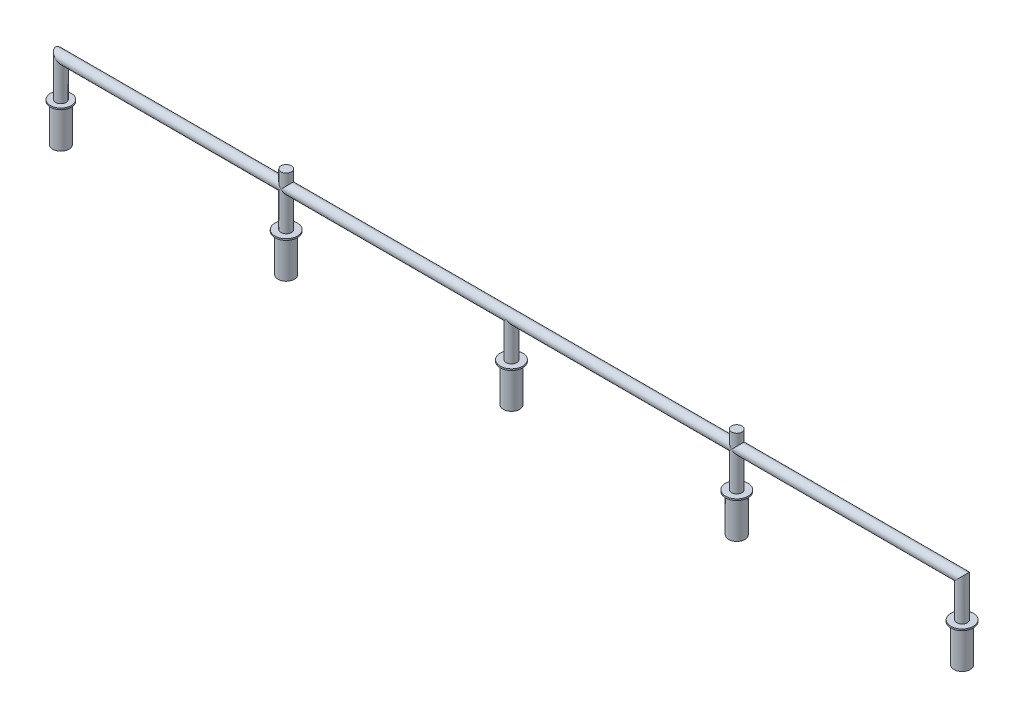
from build123d import *

# Parameters (mm, degrees)
BARRER1_PROFILE_R       = 7
BARRER2_PROFILE_R       = 7
BARRER3_PROFILE_R       = 7
BARRER4_PROFILE_R       = 7
BARRER5_PROFILE_R       = 7
BARRER6_PROFILE_R       = 7
CROQUIS128_R            = 14
CROQUIS128_R_2          = 15
SALIENTE_EXTRUIR1_DEPTH = 2
CROQUIS129_R            = 10.862522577
SALIENTE_EXTRUIR2_DEPTH = 50
MATRIZL1_COUNT          = 5
MATRIZL1_PITCH          = 300


with BuildPart() as part:
    # Barrer1: sweep along a path in Croquis1
    with BuildLine(Plane.XY) as barrer1_path:
        Line((-600, -50), (-600, 0))
        Line((-600, 0), (600, 0))
        Line((600, 0), (600, -100))
    # Barrer1 profile (on start of the path) → Barrer1 (sweep)
    with BuildSketch(Plane(origin=(-600, -50, 0), x_dir=(0, 0, 1), z_dir=(0, 1, 0))):
        Circle(BARRER1_PROFILE_R)
    sweep(path=barrer1_path.line, transition=Transition.RIGHT)

    # Barrer2: sweep along a path in Croquis12
    with BuildLine(Plane.XY) as barrer2_path:
        Line((-300, 0), (-300, -100))
    # Barrer2 profile (on start of the path) → Barrer2 (sweep)
    with BuildSketch(Plane(origin=(-300, 0, 0), x_dir=(0, 0, -1), z_dir=(0, -1, 0))):
        Circle(BARRER2_PROFILE_R)
    sweep(path=barrer2_path.line)

    # Barrer3: sweep along a path in Croquis94
    with BuildLine(Plane.XY) as barrer3_path:
        Line((0, -100), (0, 0))
    # Barrer3 profile (on start of the path) → Barrer3 (sweep)
    with BuildSketch(Plane.ZX.offset(-100)):
        Circle(BARRER3_PROFILE_R)
    sweep(path=barrer3_path.line)

    # Barrer4: sweep along a path in Croquis107
    with BuildLine(Plane.XY) as barrer4_path:
        Line((300, 0), (300, -100))
    # Barrer4 profile (on start of the path) → Barrer4 (sweep)
    with BuildSketch(Plane(origin=(300, 0, 0), x_dir=(0, 0, -1), z_dir=(0, -1, 0))):
        Circle(BARRER4_PROFILE_R)
    sweep(path=barrer4_path.line)

    # Barrer5: sweep along a path in Croquis108
    with BuildLine(Plane.XY) as barrer5_path:
        Line((-300, 0), (-300, 20))
    # Barrer5 profile (on start of the path) → Barrer5 (sweep)
    with BuildSketch(Plane(origin=(-300, 0, 0), x_dir=(0, 0, 1), z_dir=(0, 1, 0))):
        Circle(BARRER5_PROFILE_R)
    sweep(path=barrer5_path.line)

    # Barrer6: sweep along a path in Croquis109
    with BuildLine(Plane.XY) as barrer6_path:
        Line((300, 0), (300, 20))
    # Barrer6 profile (on start of the path) → Barrer6 (sweep)
    with BuildSketch(Plane(origin=(300, 0, 0), x_dir=(0, 0, 1), z_dir=(0, 1, 0))):
        Circle(BARRER6_PROFILE_R)
    sweep(path=barrer6_path.line)

    # Croquis128 → Saliente-Extruir1 (add)
    with BuildSketch(Plane.XZ.offset(50)):
        with Locations((-600, 0)):
            Circle(CROQUIS128_R)
        with Locations((-300, 0)):
            Circle(CROQUIS128_R_2)
        Circle(CROQUIS128_R_2)
        with Locations((300, 0)):
            Circle(CROQUIS128_R_2)
        with Locations((600, 0)):
            Circle(CROQUIS128_R_2)
    extrude(amount=SALIENTE_EXTRUIR1_DEPTH)


with BuildPart() as body_2:
    # Croquis129 → Saliente-Extruir2 (new body)
    with BuildSketch(Plane.XZ.offset(52)):
        with Locations((-600, 0)):
            Circle(CROQUIS129_R)
    extrude(amount=SALIENTE_EXTRUIR2_DEPTH)


with BuildPart() as matrizl1_1:
    # MatrizL1: pattern copy
    add(body_2.part.moved(Location(Vector(1, 0, 0) * (1 * MATRIZL1_PITCH))))


with BuildPart() as matrizl1_2:
    # MatrizL1: pattern copy
    add(body_2.part.moved(Location(Vector(1, 0, 0) * (2 * MATRIZL1_PITCH))))


with BuildPart() as matrizl1_3:
    # MatrizL1: pattern copy
    add(body_2.part.moved(Location(Vector(1, 0, 0) * (3 * MATRIZL1_PITCH))))


with BuildPart() as matrizl1_4:
    # MatrizL1: pattern copy
    add(body_2.part.moved(Location(Vector(1, 0, 0) * (4 * MATRIZL1_PITCH))))


solid = Compound([part.part, body_2.part, matrizl1_1.part, matrizl1_2.part, matrizl1_3.part, matrizl1_4.part])
